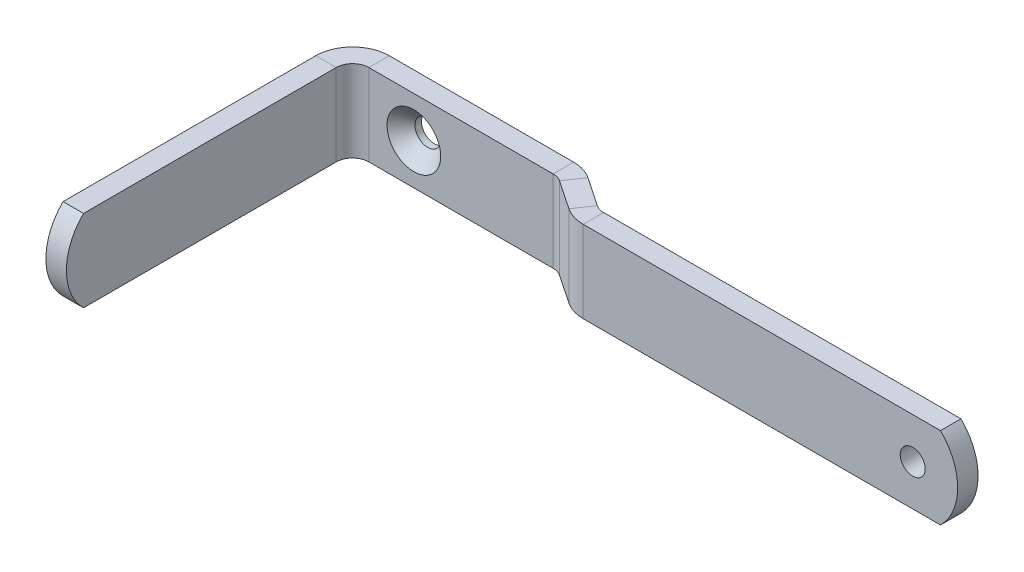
ISO-10303-21;
HEADER;
FILE_DESCRIPTION(('STEP AP214'),'2;1');
FILE_NAME('part.step','',(''),(''),'','','');
FILE_SCHEMA(('AUTOMOTIVE_DESIGN { 1 0 10303 214 1 1 1 1 }'));
ENDSEC;
DATA;
#1=APPLICATION_CONTEXT('core data for automotive mechanical design processes');
#2=APPLICATION_PROTOCOL_DEFINITION('international standard','automotive_design',2000,#1);
#3=PRODUCT_CONTEXT('',#1,'mechanical');
#4=PRODUCT('Part','Part','',(#3));
#5=PRODUCT_RELATED_PRODUCT_CATEGORY('part','',(#4));
#6=PRODUCT_DEFINITION_FORMATION('','',#4);
#7=PRODUCT_DEFINITION_CONTEXT('part definition',#1,'design');
#8=PRODUCT_DEFINITION('design','',#6,#7);
#9=PRODUCT_DEFINITION_SHAPE('','',#8);
#10=(LENGTH_UNIT() NAMED_UNIT(*) SI_UNIT(.MILLI.,.METRE.));
#11=(NAMED_UNIT(*) PLANE_ANGLE_UNIT() SI_UNIT($,.RADIAN.));
#12=(NAMED_UNIT(*) SI_UNIT($,.STERADIAN.) SOLID_ANGLE_UNIT());
#13=UNCERTAINTY_MEASURE_WITH_UNIT(LENGTH_MEASURE(1.E-05),#10,'distance_accuracy_value','');
#14=(GEOMETRIC_REPRESENTATION_CONTEXT(3) GLOBAL_UNCERTAINTY_ASSIGNED_CONTEXT((#13)) GLOBAL_UNIT_ASSIGNED_CONTEXT((#10,
#11,#12)) REPRESENTATION_CONTEXT('',''));
#15=CARTESIAN_POINT('',(0.,0.,0.));
#16=DIRECTION('',(0.,0.,1.));
#17=DIRECTION('',(1.,0.,0.));
#18=AXIS2_PLACEMENT_3D('',#15,#16,#17);
#19=CARTESIAN_POINT('',(0.,0.,0.));
#20=DIRECTION('',(-1.,0.,0.));
#21=DIRECTION('',(0.,0.,1.));
#22=AXIS2_PLACEMENT_3D('',#19,#20,#21);
#23=PLANE('',#22);
#24=CARTESIAN_POINT('',(0.,0.,-14.));
#25=DIRECTION('',(-1.,0.,0.));
#26=DIRECTION('',(0.,0.,1.));
#27=AXIS2_PLACEMENT_3D('',#24,#25,#26);
#28=CIRCLE('',#27,14.);
#29=CARTESIAN_POINT('',(0.,10.,-4.20204102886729));
#30=VERTEX_POINT('',#29);
#31=CARTESIAN_POINT('',(0.,-10.,-4.20204102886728));
#32=VERTEX_POINT('',#31);
#33=EDGE_CURVE('E169',#30,#32,#28,.F.);
#34=ORIENTED_EDGE('',*,*,#33,.T.);
#35=DIRECTION('',(0.,0.,-1.));
#36=VECTOR('',#35,1.);
#37=CARTESIAN_POINT('',(0.,-10.,0.));
#38=LINE('',#37,#36);
#39=CARTESIAN_POINT('',(0.,-9.99999999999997,-66.));
#40=VERTEX_POINT('',#39);
#41=EDGE_CURVE('E173',#32,#40,#38,.T.);
#42=ORIENTED_EDGE('',*,*,#41,.T.);
#43=DIRECTION('',(0.,1.,0.));
#44=VECTOR('',#43,1.);
#45=CARTESIAN_POINT('',(0.,10.,-66.));
#46=LINE('',#45,#44);
#47=CARTESIAN_POINT('',(0.,9.99999999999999,-66.));
#48=VERTEX_POINT('',#47);
#49=EDGE_CURVE('E393',#48,#40,#46,.F.);
#50=ORIENTED_EDGE('',*,*,#49,.F.);
#51=DIRECTION('',(0.,0.,1.));
#52=VECTOR('',#51,1.);
#53=CARTESIAN_POINT('',(0.,10.,0.));
#54=LINE('',#53,#52);
#55=EDGE_CURVE('E176',#48,#30,#54,.T.);
#56=ORIENTED_EDGE('',*,*,#55,.T.);
#57=EDGE_LOOP('',(#34,#42,#50,#56));
#58=FACE_BOUND('',#57,.T.);
#59=ADVANCED_FACE('F57',(#58),#23,.F.);
#60=CARTESIAN_POINT('',(-5.,0.,0.));
#61=DIRECTION('',(-1.,0.,0.));
#62=DIRECTION('',(0.,0.,1.));
#63=AXIS2_PLACEMENT_3D('',#60,#61,#62);
#64=PLANE('',#63);
#65=DIRECTION('',(0.,0.,-1.));
#66=VECTOR('',#65,1.);
#67=CARTESIAN_POINT('',(-5.,-10.,0.));
#68=LINE('',#67,#66);
#69=CARTESIAN_POINT('',(-5.,-10.,-4.20204102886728));
#70=VERTEX_POINT('',#69);
#71=CARTESIAN_POINT('',(-5.,-9.99999999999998,-66.));
#72=VERTEX_POINT('',#71);
#73=EDGE_CURVE('E190',#70,#72,#68,.T.);
#74=ORIENTED_EDGE('',*,*,#73,.F.);
#75=CARTESIAN_POINT('',(-5.,0.,-14.));
#76=DIRECTION('',(-1.,0.,0.));
#77=DIRECTION('',(0.,0.,1.));
#78=AXIS2_PLACEMENT_3D('',#75,#76,#77);
#79=CIRCLE('',#78,14.);
#80=CARTESIAN_POINT('',(-5.,10.,-4.20204102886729));
#81=VERTEX_POINT('',#80);
#82=EDGE_CURVE('E177',#81,#70,#79,.F.);
#83=ORIENTED_EDGE('',*,*,#82,.F.);
#84=DIRECTION('',(0.,0.,1.));
#85=VECTOR('',#84,1.);
#86=CARTESIAN_POINT('',(-5.,10.,0.));
#87=LINE('',#86,#85);
#88=CARTESIAN_POINT('',(-5.00000000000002,9.99999999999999,-66.));
#89=VERTEX_POINT('',#88);
#90=EDGE_CURVE('E194',#89,#81,#87,.T.);
#91=ORIENTED_EDGE('',*,*,#90,.F.);
#92=DIRECTION('',(0.,1.,0.));
#93=VECTOR('',#92,1.);
#94=CARTESIAN_POINT('',(-5.00000000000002,10.,-66.));
#95=LINE('',#94,#93);
#96=EDGE_CURVE('E192',#89,#72,#95,.F.);
#97=ORIENTED_EDGE('',*,*,#96,.T.);
#98=EDGE_LOOP('',(#74,#83,#91,#97));
#99=FACE_BOUND('',#98,.T.);
#100=ADVANCED_FACE('F262',(#99),#64,.T.);
#101=CARTESIAN_POINT('',(-5.,-10.,0.));
#102=DIRECTION('',(0.,-1.,0.));
#103=DIRECTION('',(0.,0.,-1.));
#104=AXIS2_PLACEMENT_3D('',#101,#102,#103);
#105=PLANE('',#104);
#106=ORIENTED_EDGE('',*,*,#41,.F.);
#107=DIRECTION('',(1.,0.,0.));
#108=VECTOR('',#107,1.);
#109=CARTESIAN_POINT('',(0.,-10.,-4.20204102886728));
#110=LINE('',#109,#108);
#111=EDGE_CURVE('E180',#32,#70,#110,.F.);
#112=ORIENTED_EDGE('',*,*,#111,.T.);
#113=ORIENTED_EDGE('',*,*,#73,.T.);
#114=DIRECTION('',(-1.,0.,0.));
#115=VECTOR('',#114,1.);
#116=CARTESIAN_POINT('',(0.,-9.99999999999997,-66.));
#117=LINE('',#116,#115);
#118=EDGE_CURVE('E189',#40,#72,#117,.T.);
#119=ORIENTED_EDGE('',*,*,#118,.F.);
#120=EDGE_LOOP('',(#106,#112,#113,#119));
#121=FACE_BOUND('',#120,.T.);
#122=ADVANCED_FACE('F187',(#121),#105,.T.);
#123=CARTESIAN_POINT('',(-5.,10.,0.));
#124=DIRECTION('',(0.,1.,0.));
#125=DIRECTION('',(0.,0.,1.));
#126=AXIS2_PLACEMENT_3D('',#123,#124,#125);
#127=PLANE('',#126);
#128=ORIENTED_EDGE('',*,*,#90,.T.);
#129=DIRECTION('',(-1.,0.,0.));
#130=VECTOR('',#129,1.);
#131=CARTESIAN_POINT('',(-5.,10.,-4.20204102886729));
#132=LINE('',#131,#130);
#133=EDGE_CURVE('E72',#81,#30,#132,.F.);
#134=ORIENTED_EDGE('',*,*,#133,.T.);
#135=ORIENTED_EDGE('',*,*,#55,.F.);
#136=DIRECTION('',(-1.,0.,0.));
#137=VECTOR('',#136,1.);
#138=CARTESIAN_POINT('',(0.,9.99999999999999,-66.));
#139=LINE('',#138,#137);
#140=EDGE_CURVE('E200',#48,#89,#139,.T.);
#141=ORIENTED_EDGE('',*,*,#140,.T.);
#142=EDGE_LOOP('',(#128,#134,#135,#141));
#143=FACE_BOUND('',#142,.T.);
#144=ADVANCED_FACE('F271',(#143),#127,.T.);
#145=CARTESIAN_POINT('',(-1.90547234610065,0.,-68.));
#146=DIRECTION('',(0.,0.,1.));
#147=DIRECTION('',(1.,0.,0.));
#148=AXIS2_PLACEMENT_3D('',#145,#146,#147);
#149=PLANE('',#148);
#150=CARTESIAN_POINT('',(144.,0.,-68.0000000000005));
#151=DIRECTION('',(0.,0.,1.));
#152=DIRECTION('',(1.,0.,0.));
#153=AXIS2_PLACEMENT_3D('',#150,#151,#152);
#154=CIRCLE('',#153,3.05000000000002);
#155=CARTESIAN_POINT('',(147.05,0.,-68.0000000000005));
#156=VERTEX_POINT('',#155);
#157=EDGE_CURVE('E776',#156,#156,#154,.T.);
#158=ORIENTED_EDGE('',*,*,#157,.T.);
#159=EDGE_LOOP('',(#158));
#160=FACE_BOUND('',#159,.T.);
#161=DIRECTION('',(1.,0.,0.));
#162=VECTOR('',#161,1.);
#163=CARTESIAN_POINT('',(153.0945276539,9.99999999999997,-68.0000000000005));
#164=LINE('',#163,#162);
#165=CARTESIAN_POINT('',(63.423836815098,9.99999999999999,-68.0000000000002));
#166=VERTEX_POINT('',#165);
#167=CARTESIAN_POINT('',(150.797958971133,9.99999999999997,-68.0000000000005));
#168=VERTEX_POINT('',#167);
#169=EDGE_CURVE('E426',#166,#168,#164,.T.);
#170=ORIENTED_EDGE('',*,*,#169,.T.);
#171=CARTESIAN_POINT('',(141.,0.,-68.0000000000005));
#172=DIRECTION('',(0.,0.,1.));
#173=DIRECTION('',(1.,0.,0.));
#174=AXIS2_PLACEMENT_3D('',#171,#172,#173);
#175=CIRCLE('',#174,14.);
#176=CARTESIAN_POINT('',(150.797958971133,-9.99999999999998,-68.0000000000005));
#177=VERTEX_POINT('',#176);
#178=EDGE_CURVE('E410',#177,#168,#175,.T.);
#179=ORIENTED_EDGE('',*,*,#178,.F.);
#180=DIRECTION('',(-1.,0.,0.));
#181=VECTOR('',#180,1.);
#182=CARTESIAN_POINT('',(-1.90547234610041,-9.99999999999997,-68.));
#183=LINE('',#182,#181);
#184=CARTESIAN_POINT('',(63.423836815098,-9.99999999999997,-68.0000000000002));
#185=VERTEX_POINT('',#184);
#186=EDGE_CURVE('E432',#177,#185,#183,.T.);
#187=ORIENTED_EDGE('',*,*,#186,.T.);
#188=DIRECTION('',(0.,1.,0.));
#189=VECTOR('',#188,1.);
#190=CARTESIAN_POINT('',(63.423836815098,0.,-68.0000000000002));
#191=LINE('',#190,#189);
#192=EDGE_CURVE('E429',#185,#166,#191,.T.);
#193=ORIENTED_EDGE('',*,*,#192,.T.);
#194=EDGE_LOOP('',(#170,#179,#187,#193));
#195=FACE_BOUND('',#194,.T.);
#196=ADVANCED_FACE('F448',(#160,#195),#149,.F.);
#197=CARTESIAN_POINT('',(-1.90547234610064,0.,-63.));
#198=DIRECTION('',(0.,0.,1.));
#199=DIRECTION('',(1.,0.,0.));
#200=AXIS2_PLACEMENT_3D('',#197,#198,#199);
#201=PLANE('',#200);
#202=CARTESIAN_POINT('',(144.,0.,-63.));
#203=DIRECTION('',(0.,0.,1.));
#204=DIRECTION('',(1.,0.,0.));
#205=AXIS2_PLACEMENT_3D('',#202,#203,#204);
#206=CIRCLE('',#205,3.05000000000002);
#207=CARTESIAN_POINT('',(147.05,0.,-63.));
#208=VERTEX_POINT('',#207);
#209=EDGE_CURVE('E775',#208,#208,#206,.T.);
#210=ORIENTED_EDGE('',*,*,#209,.F.);
#211=EDGE_LOOP('',(#210));
#212=FACE_BOUND('',#211,.T.);
#213=CARTESIAN_POINT('',(141.,0.,-63.0000000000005));
#214=DIRECTION('',(0.,0.,1.));
#215=DIRECTION('',(1.,0.,0.));
#216=AXIS2_PLACEMENT_3D('',#213,#214,#215);
#217=CIRCLE('',#216,14.);
#218=CARTESIAN_POINT('',(150.797958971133,-9.99999999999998,-63.0000000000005));
#219=VERTEX_POINT('',#218);
#220=CARTESIAN_POINT('',(150.797958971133,9.99999999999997,-63.0000000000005));
#221=VERTEX_POINT('',#220);
#222=EDGE_CURVE('E80',#219,#221,#217,.T.);
#223=ORIENTED_EDGE('',*,*,#222,.T.);
#224=DIRECTION('',(1.,0.,0.));
#225=VECTOR('',#224,1.);
#226=CARTESIAN_POINT('',(153.0945276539,9.99999999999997,-63.0000000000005));
#227=LINE('',#226,#225);
#228=CARTESIAN_POINT('',(63.423836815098,9.99999999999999,-63.0000000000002));
#229=VERTEX_POINT('',#228);
#230=EDGE_CURVE('E420',#229,#221,#227,.T.);
#231=ORIENTED_EDGE('',*,*,#230,.F.);
#232=DIRECTION('',(0.,1.,0.));
#233=VECTOR('',#232,1.);
#234=CARTESIAN_POINT('',(63.423836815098,0.,-63.0000000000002));
#235=LINE('',#234,#233);
#236=CARTESIAN_POINT('',(63.423836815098,-9.99999999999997,-63.0000000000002));
#237=VERTEX_POINT('',#236);
#238=EDGE_CURVE('E417',#237,#229,#235,.T.);
#239=ORIENTED_EDGE('',*,*,#238,.F.);
#240=DIRECTION('',(-1.,0.,0.));
#241=VECTOR('',#240,1.);
#242=CARTESIAN_POINT('',(-1.9054723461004,-9.99999999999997,-63.));
#243=LINE('',#242,#241);
#244=EDGE_CURVE('E349',#219,#237,#243,.T.);
#245=ORIENTED_EDGE('',*,*,#244,.F.);
#246=EDGE_LOOP('',(#223,#231,#239,#245));
#247=FACE_BOUND('',#246,.T.);
#248=ADVANCED_FACE('F454',(#212,#247),#201,.T.);
#249=CARTESIAN_POINT('',(153.0945276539,9.99999999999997,-68.0000000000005));
#250=DIRECTION('',(0.,-1.,0.));
#251=DIRECTION('',(1.,0.,0.));
#252=AXIS2_PLACEMENT_3D('',#249,#250,#251);
#253=PLANE('',#252);
#254=DIRECTION('',(0.,0.,1.));
#255=VECTOR('',#254,1.);
#256=CARTESIAN_POINT('',(150.797958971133,9.99999999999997,-63.0000000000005));
#257=LINE('',#256,#255);
#258=EDGE_CURVE('E407',#221,#168,#257,.F.);
#259=ORIENTED_EDGE('',*,*,#258,.T.);
#260=ORIENTED_EDGE('',*,*,#169,.F.);
#261=DIRECTION('',(0.,0.,1.));
#262=VECTOR('',#261,1.);
#263=CARTESIAN_POINT('',(63.423836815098,9.99999999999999,-68.0000000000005));
#264=LINE('',#263,#262);
#265=EDGE_CURVE('E423',#166,#229,#264,.T.);
#266=ORIENTED_EDGE('',*,*,#265,.T.);
#267=ORIENTED_EDGE('',*,*,#230,.T.);
#268=EDGE_LOOP('',(#259,#260,#266,#267));
#269=FACE_BOUND('',#268,.T.);
#270=ADVANCED_FACE('F445',(#269),#253,.F.);
#271=CARTESIAN_POINT('',(-1.90547234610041,-9.99999999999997,-68.));
#272=DIRECTION('',(0.,1.,0.));
#273=DIRECTION('',(0.,0.,1.));
#274=AXIS2_PLACEMENT_3D('',#271,#272,#273);
#275=PLANE('',#274);
#276=DIRECTION('',(0.,0.,-1.));
#277=VECTOR('',#276,1.);
#278=CARTESIAN_POINT('',(150.797958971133,-9.99999999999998,-68.0000000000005));
#279=LINE('',#278,#277);
#280=EDGE_CURVE('E415',#177,#219,#279,.F.);
#281=ORIENTED_EDGE('',*,*,#280,.T.);
#282=ORIENTED_EDGE('',*,*,#244,.T.);
#283=DIRECTION('',(0.,0.,-1.));
#284=VECTOR('',#283,1.);
#285=CARTESIAN_POINT('',(63.423836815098,-9.99999999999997,-68.));
#286=LINE('',#285,#284);
#287=EDGE_CURVE('E345',#237,#185,#286,.T.);
#288=ORIENTED_EDGE('',*,*,#287,.T.);
#289=ORIENTED_EDGE('',*,*,#186,.F.);
#290=EDGE_LOOP('',(#281,#282,#288,#289));
#291=FACE_BOUND('',#290,.T.);
#292=ADVANCED_FACE('F319',(#291),#275,.F.);
#293=CARTESIAN_POINT('',(7.42839399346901,0.,-98.9134415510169));
#294=DIRECTION('',(-0.559192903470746,0.,0.829037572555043));
#295=DIRECTION('',(0.829037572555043,0.,0.559192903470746));
#296=AXIS2_PLACEMENT_3D('',#293,#294,#295);
#297=PLANE('',#296);
#298=DIRECTION('',(-0.829037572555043,0.,-0.559192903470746));
#299=VECTOR('',#298,1.);
#300=CARTESIAN_POINT('',(7.42839399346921,-9.99999999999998,-98.9134415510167));
#301=LINE('',#300,#299);
#302=CARTESIAN_POINT('',(58.3911006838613,-9.99999999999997,-64.5386618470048));
#303=VERTEX_POINT('',#302);
#304=CARTESIAN_POINT('',(51.3081827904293,-9.99999999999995,-69.3161502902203));
#305=VERTEX_POINT('',#304);
#306=EDGE_CURVE('E237',#303,#305,#301,.T.);
#307=ORIENTED_EDGE('',*,*,#306,.F.);
#308=DIRECTION('',(0.,1.,0.));
#309=VECTOR('',#308,1.);
#310=CARTESIAN_POINT('',(58.3911006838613,0.,-64.5386618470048));
#311=LINE('',#310,#309);
#312=CARTESIAN_POINT('',(58.3911006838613,9.99999999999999,-64.5386618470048));
#313=VERTEX_POINT('',#312);
#314=EDGE_CURVE('E231',#303,#313,#311,.T.);
#315=ORIENTED_EDGE('',*,*,#314,.T.);
#316=DIRECTION('',(0.829037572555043,0.,0.559192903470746));
#317=VECTOR('',#316,1.);
#318=CARTESIAN_POINT('',(135.929217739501,9.99999999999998,-12.2385415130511));
#319=LINE('',#318,#317);
#320=CARTESIAN_POINT('',(51.3081827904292,9.99999999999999,-69.3161502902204));
#321=VERTEX_POINT('',#320);
#322=EDGE_CURVE('E240',#321,#313,#319,.T.);
#323=ORIENTED_EDGE('',*,*,#322,.F.);
#324=DIRECTION('',(0.,1.,0.));
#325=VECTOR('',#324,1.);
#326=CARTESIAN_POINT('',(51.3081827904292,0.,-69.3161502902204));
#327=LINE('',#326,#325);
#328=EDGE_CURVE('E220',#305,#321,#327,.T.);
#329=ORIENTED_EDGE('',*,*,#328,.F.);
#330=EDGE_LOOP('',(#307,#315,#323,#329));
#331=FACE_BOUND('',#330,.T.);
#332=ADVANCED_FACE('F313',(#331),#297,.T.);
#333=CARTESIAN_POINT('',(10.2243585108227,0.,-103.058629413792));
#334=DIRECTION('',(-0.559192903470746,0.,0.829037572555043));
#335=DIRECTION('',(0.829037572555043,0.,0.559192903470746));
#336=AXIS2_PLACEMENT_3D('',#333,#334,#335);
#337=PLANE('',#336);
#338=DIRECTION('',(0.,1.,0.));
#339=VECTOR('',#338,1.);
#340=CARTESIAN_POINT('',(61.187065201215,0.,-68.68384970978));
#341=LINE('',#340,#339);
#342=CARTESIAN_POINT('',(61.187065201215,-9.99999999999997,-68.68384970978));
#343=VERTEX_POINT('',#342);
#344=CARTESIAN_POINT('',(61.187065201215,9.99999999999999,-68.68384970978));
#345=VERTEX_POINT('',#344);
#346=EDGE_CURVE('E225',#343,#345,#341,.T.);
#347=ORIENTED_EDGE('',*,*,#346,.F.);
#348=DIRECTION('',(-0.829037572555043,0.,-0.559192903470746));
#349=VECTOR('',#348,1.);
#350=CARTESIAN_POINT('',(10.2243585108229,-9.99999999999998,-103.058629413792));
#351=LINE('',#350,#349);
#352=CARTESIAN_POINT('',(54.104147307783,-9.99999999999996,-73.4613381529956));
#353=VERTEX_POINT('',#352);
#354=EDGE_CURVE('E243',#343,#353,#351,.T.);
#355=ORIENTED_EDGE('',*,*,#354,.T.);
#356=DIRECTION('',(0.,1.,0.));
#357=VECTOR('',#356,1.);
#358=CARTESIAN_POINT('',(54.104147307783,0.,-73.4613381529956));
#359=LINE('',#358,#357);
#360=CARTESIAN_POINT('',(54.104147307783,9.99999999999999,-73.4613381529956));
#361=VERTEX_POINT('',#360);
#362=EDGE_CURVE('E213',#353,#361,#359,.T.);
#363=ORIENTED_EDGE('',*,*,#362,.T.);
#364=DIRECTION('',(0.829037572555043,0.,0.559192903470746));
#365=VECTOR('',#364,1.);
#366=CARTESIAN_POINT('',(138.725182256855,9.99999999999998,-16.3837293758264));
#367=LINE('',#366,#365);
#368=EDGE_CURVE('E217',#361,#345,#367,.T.);
#369=ORIENTED_EDGE('',*,*,#368,.T.);
#370=EDGE_LOOP('',(#347,#355,#363,#369));
#371=FACE_BOUND('',#370,.T.);
#372=ADVANCED_FACE('F309',(#371),#337,.F.);
#373=CARTESIAN_POINT('',(138.725182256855,9.99999999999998,-16.3837293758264));
#374=DIRECTION('',(0.,-1.,0.));
#375=DIRECTION('',(0.829037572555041,0.,0.559192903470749));
#376=AXIS2_PLACEMENT_3D('',#373,#374,#375);
#377=PLANE('',#376);
#378=DIRECTION('',(-0.559192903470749,0.,0.829037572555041));
#379=VECTOR('',#378,1.);
#380=CARTESIAN_POINT('',(61.1870652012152,9.99999999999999,-68.6838497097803));
#381=LINE('',#380,#379);
#382=EDGE_CURVE('E228',#345,#313,#381,.T.);
#383=ORIENTED_EDGE('',*,*,#382,.F.);
#384=ORIENTED_EDGE('',*,*,#368,.F.);
#385=DIRECTION('',(-0.559192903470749,0.,0.829037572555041));
#386=VECTOR('',#385,1.);
#387=CARTESIAN_POINT('',(54.1041473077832,9.99999999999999,-73.4613381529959));
#388=LINE('',#387,#386);
#389=EDGE_CURVE('E222',#361,#321,#388,.T.);
#390=ORIENTED_EDGE('',*,*,#389,.T.);
#391=ORIENTED_EDGE('',*,*,#322,.T.);
#392=EDGE_LOOP('',(#383,#384,#390,#391));
#393=FACE_BOUND('',#392,.T.);
#394=ADVANCED_FACE('F312',(#393),#377,.F.);
#395=CARTESIAN_POINT('',(10.2243585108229,-9.99999999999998,-103.058629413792));
#396=DIRECTION('',(0.,1.,0.));
#397=DIRECTION('',(-0.559192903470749,0.,0.829037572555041));
#398=AXIS2_PLACEMENT_3D('',#395,#396,#397);
#399=PLANE('',#398);
#400=DIRECTION('',(0.559192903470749,0.,-0.829037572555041));
#401=VECTOR('',#400,1.);
#402=CARTESIAN_POINT('',(61.1870652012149,-9.99999999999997,-68.6838497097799));
#403=LINE('',#402,#401);
#404=EDGE_CURVE('E234',#303,#343,#403,.T.);
#405=ORIENTED_EDGE('',*,*,#404,.F.);
#406=ORIENTED_EDGE('',*,*,#306,.T.);
#407=DIRECTION('',(0.559192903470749,0.,-0.829037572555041));
#408=VECTOR('',#407,1.);
#409=CARTESIAN_POINT('',(54.1041473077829,-9.99999999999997,-73.4613381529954));
#410=LINE('',#409,#408);
#411=EDGE_CURVE('E216',#305,#353,#410,.T.);
#412=ORIENTED_EDGE('',*,*,#411,.T.);
#413=ORIENTED_EDGE('',*,*,#354,.F.);
#414=EDGE_LOOP('',(#405,#406,#412,#413));
#415=FACE_BOUND('',#414,.T.);
#416=ADVANCED_FACE('F279',(#415),#399,.F.);
#417=CARTESIAN_POINT('',(3.99999999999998,9.99999999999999,-66.));
#418=DIRECTION('',(0.,-1.,0.));
#419=DIRECTION('',(0.,0.,-1.));
#420=AXIS2_PLACEMENT_3D('',#417,#418,#419);
#421=PLANE('',#420);
#422=CARTESIAN_POINT('',(3.99999999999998,9.99999999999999,-66.));
#423=DIRECTION('',(0.,1.,0.));
#424=DIRECTION('',(0.,0.,1.));
#425=AXIS2_PLACEMENT_3D('',#422,#423,#424);
#426=CIRCLE('',#425,3.99999999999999);
#427=CARTESIAN_POINT('',(3.99999999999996,9.99999999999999,-70.));
#428=VERTEX_POINT('',#427);
#429=EDGE_CURVE('E385',#428,#48,#426,.T.);
#430=ORIENTED_EDGE('',*,*,#429,.F.);
#431=DIRECTION('',(0.,0.,-1.));
#432=VECTOR('',#431,1.);
#433=CARTESIAN_POINT('',(3.99999999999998,9.99999999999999,-70.));
#434=LINE('',#433,#432);
#435=CARTESIAN_POINT('',(3.99999999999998,10.,-75.));
#436=VERTEX_POINT('',#435);
#437=EDGE_CURVE('E398',#428,#436,#434,.T.);
#438=ORIENTED_EDGE('',*,*,#437,.T.);
#439=CARTESIAN_POINT('',(3.99999999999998,9.99999999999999,-66.));
#440=DIRECTION('',(0.,1.,0.));
#441=DIRECTION('',(0.,0.,1.));
#442=AXIS2_PLACEMENT_3D('',#439,#440,#441);
#443=CIRCLE('',#442,8.99999999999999);
#444=EDGE_CURVE('E395',#436,#89,#443,.T.);
#445=ORIENTED_EDGE('',*,*,#444,.T.);
#446=ORIENTED_EDGE('',*,*,#140,.F.);
#447=EDGE_LOOP('',(#430,#438,#445,#446));
#448=FACE_BOUND('',#447,.T.);
#449=ADVANCED_FACE('F275',(#448),#421,.F.);
#450=CARTESIAN_POINT('',(3.99999999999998,10.,-66.));
#451=DIRECTION('',(0.,1.,0.));
#452=DIRECTION('',(0.,0.,-1.));
#453=AXIS2_PLACEMENT_3D('',#450,#451,#452);
#454=CYLINDRICAL_SURFACE('',#453,3.99999999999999);
#455=ORIENTED_EDGE('',*,*,#49,.T.);
#456=CARTESIAN_POINT('',(3.99999999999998,-9.99999999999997,-66.));
#457=DIRECTION('',(0.,1.,0.));
#458=DIRECTION('',(0.,0.,1.));
#459=AXIS2_PLACEMENT_3D('',#456,#457,#458);
#460=CIRCLE('',#459,3.99999999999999);
#461=CARTESIAN_POINT('',(3.99999999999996,-9.99999999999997,-70.));
#462=VERTEX_POINT('',#461);
#463=EDGE_CURVE('E390',#40,#462,#460,.F.);
#464=ORIENTED_EDGE('',*,*,#463,.T.);
#465=DIRECTION('',(0.,1.,0.));
#466=VECTOR('',#465,1.);
#467=CARTESIAN_POINT('',(3.99999999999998,-9.99999999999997,-70.));
#468=LINE('',#467,#466);
#469=EDGE_CURVE('E388',#462,#428,#468,.T.);
#470=ORIENTED_EDGE('',*,*,#469,.T.);
#471=ORIENTED_EDGE('',*,*,#429,.T.);
#472=EDGE_LOOP('',(#455,#464,#470,#471));
#473=FACE_BOUND('',#472,.T.);
#474=ADVANCED_FACE('F278',(#473),#454,.F.);
#475=CARTESIAN_POINT('',(3.99999999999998,-9.99999999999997,-66.));
#476=DIRECTION('',(0.,-1.,0.));
#477=DIRECTION('',(0.,0.,-1.));
#478=AXIS2_PLACEMENT_3D('',#475,#476,#477);
#479=PLANE('',#478);
#480=DIRECTION('',(0.,0.,-1.));
#481=VECTOR('',#480,1.);
#482=CARTESIAN_POINT('',(3.99999999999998,-9.99999999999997,-70.));
#483=LINE('',#482,#481);
#484=CARTESIAN_POINT('',(3.99999999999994,-9.99999999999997,-75.));
#485=VERTEX_POINT('',#484);
#486=EDGE_CURVE('E369',#462,#485,#483,.T.);
#487=ORIENTED_EDGE('',*,*,#486,.F.);
#488=ORIENTED_EDGE('',*,*,#463,.F.);
#489=ORIENTED_EDGE('',*,*,#118,.T.);
#490=CARTESIAN_POINT('',(3.99999999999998,-9.99999999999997,-66.));
#491=DIRECTION('',(0.,1.,0.));
#492=DIRECTION('',(0.,0.,1.));
#493=AXIS2_PLACEMENT_3D('',#490,#491,#492);
#494=CIRCLE('',#493,8.99999999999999);
#495=EDGE_CURVE('E381',#72,#485,#494,.F.);
#496=ORIENTED_EDGE('',*,*,#495,.T.);
#497=EDGE_LOOP('',(#487,#488,#489,#496));
#498=FACE_BOUND('',#497,.T.);
#499=ADVANCED_FACE('F283',(#498),#479,.T.);
#500=CARTESIAN_POINT('',(3.99999999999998,10.,-66.));
#501=DIRECTION('',(0.,1.,0.));
#502=DIRECTION('',(0.,0.,-1.));
#503=AXIS2_PLACEMENT_3D('',#500,#501,#502);
#504=CYLINDRICAL_SURFACE('',#503,8.99999999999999);
#505=ORIENTED_EDGE('',*,*,#96,.F.);
#506=ORIENTED_EDGE('',*,*,#444,.F.);
#507=DIRECTION('',(0.,-1.,0.));
#508=VECTOR('',#507,1.);
#509=CARTESIAN_POINT('',(3.99999999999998,0.,-75.));
#510=LINE('',#509,#508);
#511=EDGE_CURVE('E378',#436,#485,#510,.T.);
#512=ORIENTED_EDGE('',*,*,#511,.T.);
#513=ORIENTED_EDGE('',*,*,#495,.F.);
#514=EDGE_LOOP('',(#505,#506,#512,#513));
#515=FACE_BOUND('',#514,.T.);
#516=ADVANCED_FACE('F287',(#515),#504,.T.);
#517=CARTESIAN_POINT('',(-2.61885540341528E-13,0.,-75.));
#518=DIRECTION('',(0.,0.,1.));
#519=DIRECTION('',(1.,0.,0.));
#520=AXIS2_PLACEMENT_3D('',#517,#518,#519);
#521=PLANE('',#520);
#522=CARTESIAN_POINT('',(15.,0.,-75.0000000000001));
#523=DIRECTION('',(0.,0.,-1.));
#524=DIRECTION('',(-1.,0.,0.));
#525=AXIS2_PLACEMENT_3D('',#522,#523,#524);
#526=CIRCLE('',#525,3.15);
#527=CARTESIAN_POINT('',(11.85,0.,-75.0000000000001));
#528=VERTEX_POINT('',#527);
#529=EDGE_CURVE('E184',#528,#528,#526,.T.);
#530=ORIENTED_EDGE('',*,*,#529,.F.);
#531=EDGE_LOOP('',(#530));
#532=FACE_BOUND('',#531,.T.);
#533=DIRECTION('',(0.,1.,0.));
#534=VECTOR('',#533,1.);
#535=CARTESIAN_POINT('',(49.0714111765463,0.,-75.0000000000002));
#536=LINE('',#535,#534);
#537=CARTESIAN_POINT('',(49.0714111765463,-9.99999999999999,-75.0000000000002));
#538=VERTEX_POINT('',#537);
#539=CARTESIAN_POINT('',(49.0714111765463,9.99999999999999,-75.0000000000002));
#540=VERTEX_POINT('',#539);
#541=EDGE_CURVE('E209',#538,#540,#536,.T.);
#542=ORIENTED_EDGE('',*,*,#541,.F.);
#543=DIRECTION('',(-1.,0.,0.));
#544=VECTOR('',#543,1.);
#545=CARTESIAN_POINT('',(0.,-9.99999999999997,-75.));
#546=LINE('',#545,#544);
#547=EDGE_CURVE('E376',#538,#485,#546,.T.);
#548=ORIENTED_EDGE('',*,*,#547,.T.);
#549=ORIENTED_EDGE('',*,*,#511,.F.);
#550=DIRECTION('',(1.,0.,0.));
#551=VECTOR('',#550,1.);
#552=CARTESIAN_POINT('',(155.,9.99999999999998,-75.0000000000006));
#553=LINE('',#552,#551);
#554=EDGE_CURVE('E374',#436,#540,#553,.T.);
#555=ORIENTED_EDGE('',*,*,#554,.T.);
#556=EDGE_LOOP('',(#542,#548,#549,#555));
#557=FACE_BOUND('',#556,.T.);
#558=ADVANCED_FACE('F291',(#532,#557),#521,.F.);
#559=CARTESIAN_POINT('',(0.,-9.99999999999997,-75.));
#560=DIRECTION('',(0.,1.,0.));
#561=DIRECTION('',(0.,0.,1.));
#562=AXIS2_PLACEMENT_3D('',#559,#560,#561);
#563=PLANE('',#562);
#564=DIRECTION('',(0.,0.,-1.));
#565=VECTOR('',#564,1.);
#566=CARTESIAN_POINT('',(49.0714111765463,-9.99999999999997,-75.));
#567=LINE('',#566,#565);
#568=CARTESIAN_POINT('',(49.0714111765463,-9.99999999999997,-70.0000000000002));
#569=VERTEX_POINT('',#568);
#570=EDGE_CURVE('E203',#569,#538,#567,.T.);
#571=ORIENTED_EDGE('',*,*,#570,.F.);
#572=DIRECTION('',(-1.,0.,0.));
#573=VECTOR('',#572,1.);
#574=CARTESIAN_POINT('',(0.,-9.99999999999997,-70.));
#575=LINE('',#574,#573);
#576=EDGE_CURVE('E372',#569,#462,#575,.T.);
#577=ORIENTED_EDGE('',*,*,#576,.T.);
#578=ORIENTED_EDGE('',*,*,#486,.T.);
#579=ORIENTED_EDGE('',*,*,#547,.F.);
#580=EDGE_LOOP('',(#571,#577,#578,#579));
#581=FACE_BOUND('',#580,.T.);
#582=ADVANCED_FACE('F295',(#581),#563,.F.);
#583=CARTESIAN_POINT('',(-2.44428133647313E-13,0.,-70.));
#584=DIRECTION('',(0.,0.,1.));
#585=DIRECTION('',(1.,0.,0.));
#586=AXIS2_PLACEMENT_3D('',#583,#584,#585);
#587=PLANE('',#586);
#588=CARTESIAN_POINT('',(15.,0.,-70.0000000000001));
#589=DIRECTION('',(0.,0.,1.));
#590=DIRECTION('',(1.,0.,0.));
#591=AXIS2_PLACEMENT_3D('',#588,#589,#590);
#592=CIRCLE('',#591,6.56999999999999);
#593=CARTESIAN_POINT('',(21.57,0.,-70.0000000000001));
#594=VERTEX_POINT('',#593);
#595=EDGE_CURVE('E14',#594,#594,#592,.F.);
#596=ORIENTED_EDGE('',*,*,#595,.T.);
#597=EDGE_LOOP('',(#596));
#598=FACE_BOUND('',#597,.T.);
#599=ORIENTED_EDGE('',*,*,#576,.F.);
#600=DIRECTION('',(0.,1.,0.));
#601=VECTOR('',#600,1.);
#602=CARTESIAN_POINT('',(49.0714111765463,0.,-70.0000000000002));
#603=LINE('',#602,#601);
#604=CARTESIAN_POINT('',(49.0714111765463,9.99999999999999,-70.0000000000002));
#605=VERTEX_POINT('',#604);
#606=EDGE_CURVE('E366',#569,#605,#603,.T.);
#607=ORIENTED_EDGE('',*,*,#606,.T.);
#608=DIRECTION('',(1.,0.,0.));
#609=VECTOR('',#608,1.);
#610=CARTESIAN_POINT('',(155.,9.99999999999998,-70.0000000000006));
#611=LINE('',#610,#609);
#612=EDGE_CURVE('E241',#428,#605,#611,.T.);
#613=ORIENTED_EDGE('',*,*,#612,.F.);
#614=ORIENTED_EDGE('',*,*,#469,.F.);
#615=EDGE_LOOP('',(#599,#607,#613,#614));
#616=FACE_BOUND('',#615,.T.);
#617=ADVANCED_FACE('F299',(#598,#616),#587,.T.);
#618=CARTESIAN_POINT('',(155.,9.99999999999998,-75.0000000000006));
#619=DIRECTION('',(0.,-1.,0.));
#620=DIRECTION('',(1.,0.,0.));
#621=AXIS2_PLACEMENT_3D('',#618,#619,#620);
#622=PLANE('',#621);
#623=DIRECTION('',(0.,0.,1.));
#624=VECTOR('',#623,1.);
#625=CARTESIAN_POINT('',(49.0714111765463,9.99999999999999,-75.0000000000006));
#626=LINE('',#625,#624);
#627=EDGE_CURVE('E206',#540,#605,#626,.T.);
#628=ORIENTED_EDGE('',*,*,#627,.F.);
#629=ORIENTED_EDGE('',*,*,#554,.F.);
#630=ORIENTED_EDGE('',*,*,#437,.F.);
#631=ORIENTED_EDGE('',*,*,#612,.T.);
#632=EDGE_LOOP('',(#628,#629,#630,#631));
#633=FACE_BOUND('',#632,.T.);
#634=ADVANCED_FACE('F303',(#633),#622,.F.);
#635=CARTESIAN_POINT('',(49.0714111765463,-9.99999999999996,-66.0000000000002));
#636=DIRECTION('',(0.,-1.,0.));
#637=DIRECTION('',(1.,0.,0.));
#638=AXIS2_PLACEMENT_3D('',#635,#636,#637);
#639=PLANE('',#638);
#640=ORIENTED_EDGE('',*,*,#411,.F.);
#641=CARTESIAN_POINT('',(49.0714111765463,-9.99999999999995,-66.0000000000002));
#642=DIRECTION('',(0.,-1.,0.));
#643=DIRECTION('',(1.,0.,0.));
#644=AXIS2_PLACEMENT_3D('',#641,#642,#643);
#645=CIRCLE('',#644,3.99999999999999);
#646=EDGE_CURVE('E361',#305,#569,#645,.F.);
#647=ORIENTED_EDGE('',*,*,#646,.T.);
#648=ORIENTED_EDGE('',*,*,#570,.T.);
#649=CARTESIAN_POINT('',(49.0714111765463,-9.99999999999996,-66.0000000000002));
#650=DIRECTION('',(0.,1.,0.));
#651=DIRECTION('',(-1.,0.,0.));
#652=AXIS2_PLACEMENT_3D('',#649,#650,#651);
#653=CIRCLE('',#652,8.99999999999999);
#654=EDGE_CURVE('E353',#353,#538,#653,.T.);
#655=ORIENTED_EDGE('',*,*,#654,.F.);
#656=EDGE_LOOP('',(#640,#647,#648,#655));
#657=FACE_BOUND('',#656,.T.);
#658=ADVANCED_FACE('F307',(#657),#639,.T.);
#659=CARTESIAN_POINT('',(49.0714111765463,9.99999999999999,-66.0000000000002));
#660=DIRECTION('',(0.,1.,0.));
#661=DIRECTION('',(0.,0.,1.));
#662=AXIS2_PLACEMENT_3D('',#659,#660,#661);
#663=PLANE('',#662);
#664=ORIENTED_EDGE('',*,*,#627,.T.);
#665=CARTESIAN_POINT('',(49.0714111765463,9.99999999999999,-66.0000000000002));
#666=DIRECTION('',(0.,-1.,0.));
#667=DIRECTION('',(1.,0.,0.));
#668=AXIS2_PLACEMENT_3D('',#665,#666,#667);
#669=CIRCLE('',#668,3.99999999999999);
#670=EDGE_CURVE('E356',#605,#321,#669,.T.);
#671=ORIENTED_EDGE('',*,*,#670,.T.);
#672=ORIENTED_EDGE('',*,*,#389,.F.);
#673=CARTESIAN_POINT('',(49.0714111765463,9.99999999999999,-66.0000000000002));
#674=DIRECTION('',(0.,-1.,0.));
#675=DIRECTION('',(0.,0.,-1.));
#676=AXIS2_PLACEMENT_3D('',#673,#674,#675);
#677=CIRCLE('',#676,8.99999999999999);
#678=EDGE_CURVE('E212',#540,#361,#677,.T.);
#679=ORIENTED_EDGE('',*,*,#678,.F.);
#680=EDGE_LOOP('',(#664,#671,#672,#679));
#681=FACE_BOUND('',#680,.T.);
#682=ADVANCED_FACE('F486',(#681),#663,.T.);
#683=CARTESIAN_POINT('',(49.0714111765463,20.9732643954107,-66.0000000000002));
#684=DIRECTION('',(0.,-1.,0.));
#685=DIRECTION('',(1.,0.,0.));
#686=AXIS2_PLACEMENT_3D('',#683,#684,#685);
#687=CYLINDRICAL_SURFACE('',#686,8.99999999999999);
#688=ORIENTED_EDGE('',*,*,#678,.T.);
#689=ORIENTED_EDGE('',*,*,#362,.F.);
#690=ORIENTED_EDGE('',*,*,#654,.T.);
#691=ORIENTED_EDGE('',*,*,#541,.T.);
#692=EDGE_LOOP('',(#688,#689,#690,#691));
#693=FACE_BOUND('',#692,.T.);
#694=ADVANCED_FACE('F483',(#693),#687,.T.);
#695=CARTESIAN_POINT('',(49.0714111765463,20.9732643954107,-66.0000000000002));
#696=DIRECTION('',(0.,-1.,0.));
#697=DIRECTION('',(1.,0.,0.));
#698=AXIS2_PLACEMENT_3D('',#695,#696,#697);
#699=CYLINDRICAL_SURFACE('',#698,3.99999999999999);
#700=ORIENTED_EDGE('',*,*,#670,.F.);
#701=ORIENTED_EDGE('',*,*,#606,.F.);
#702=ORIENTED_EDGE('',*,*,#646,.F.);
#703=ORIENTED_EDGE('',*,*,#328,.T.);
#704=EDGE_LOOP('',(#700,#701,#702,#703));
#705=FACE_BOUND('',#704,.T.);
#706=ADVANCED_FACE('F482',(#705),#699,.F.);
#707=CARTESIAN_POINT('',(63.423836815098,-9.99999999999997,-72.0000000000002));
#708=DIRECTION('',(0.,1.,0.));
#709=DIRECTION('',(0.,0.,1.));
#710=AXIS2_PLACEMENT_3D('',#707,#708,#709);
#711=PLANE('',#710);
#712=ORIENTED_EDGE('',*,*,#287,.F.);
#713=CARTESIAN_POINT('',(63.423836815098,-9.99999999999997,-72.0000000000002));
#714=DIRECTION('',(0.,-1.,0.));
#715=DIRECTION('',(0.,0.,-1.));
#716=AXIS2_PLACEMENT_3D('',#713,#714,#715);
#717=CIRCLE('',#716,8.99999999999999);
#718=EDGE_CURVE('E338',#237,#303,#717,.T.);
#719=ORIENTED_EDGE('',*,*,#718,.T.);
#720=ORIENTED_EDGE('',*,*,#404,.T.);
#721=CARTESIAN_POINT('',(63.423836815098,-9.99999999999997,-72.0000000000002));
#722=DIRECTION('',(0.,-1.,0.));
#723=DIRECTION('',(0.,0.,-1.));
#724=AXIS2_PLACEMENT_3D('',#721,#722,#723);
#725=CIRCLE('',#724,3.99999999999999);
#726=EDGE_CURVE('E347',#185,#343,#725,.T.);
#727=ORIENTED_EDGE('',*,*,#726,.F.);
#728=EDGE_LOOP('',(#712,#719,#720,#727));
#729=FACE_BOUND('',#728,.T.);
#730=ADVANCED_FACE('F343',(#729),#711,.F.);
#731=CARTESIAN_POINT('',(63.423836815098,9.99999999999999,-72.0000000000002));
#732=DIRECTION('',(0.,-1.,0.));
#733=DIRECTION('',(0.,0.,-1.));
#734=AXIS2_PLACEMENT_3D('',#731,#732,#733);
#735=PLANE('',#734);
#736=ORIENTED_EDGE('',*,*,#382,.T.);
#737=CARTESIAN_POINT('',(63.423836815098,9.99999999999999,-72.0000000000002));
#738=DIRECTION('',(0.,-1.,0.));
#739=DIRECTION('',(0.,0.,-1.));
#740=AXIS2_PLACEMENT_3D('',#737,#738,#739);
#741=CIRCLE('',#740,8.99999999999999);
#742=EDGE_CURVE('E340',#313,#229,#741,.F.);
#743=ORIENTED_EDGE('',*,*,#742,.T.);
#744=ORIENTED_EDGE('',*,*,#265,.F.);
#745=CARTESIAN_POINT('',(63.423836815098,9.99999999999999,-72.0000000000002));
#746=DIRECTION('',(0.,1.,0.));
#747=DIRECTION('',(0.,0.,1.));
#748=AXIS2_PLACEMENT_3D('',#745,#746,#747);
#749=CIRCLE('',#748,3.99999999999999);
#750=EDGE_CURVE('E364',#345,#166,#749,.T.);
#751=ORIENTED_EDGE('',*,*,#750,.F.);
#752=EDGE_LOOP('',(#736,#743,#744,#751));
#753=FACE_BOUND('',#752,.T.);
#754=ADVANCED_FACE('F442',(#753),#735,.F.);
#755=CARTESIAN_POINT('',(63.423836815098,21.8091941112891,-72.0000000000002));
#756=DIRECTION('',(0.,-1.,0.));
#757=DIRECTION('',(0.,0.,-1.));
#758=AXIS2_PLACEMENT_3D('',#755,#756,#757);
#759=CYLINDRICAL_SURFACE('',#758,3.99999999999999);
#760=ORIENTED_EDGE('',*,*,#750,.T.);
#761=ORIENTED_EDGE('',*,*,#192,.F.);
#762=ORIENTED_EDGE('',*,*,#726,.T.);
#763=ORIENTED_EDGE('',*,*,#346,.T.);
#764=EDGE_LOOP('',(#760,#761,#762,#763));
#765=FACE_BOUND('',#764,.T.);
#766=ADVANCED_FACE('F439',(#765),#759,.F.);
#767=CARTESIAN_POINT('',(63.423836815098,21.8091941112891,-72.0000000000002));
#768=DIRECTION('',(0.,-1.,0.));
#769=DIRECTION('',(0.,0.,-1.));
#770=AXIS2_PLACEMENT_3D('',#767,#768,#769);
#771=CYLINDRICAL_SURFACE('',#770,8.99999999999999);
#772=ORIENTED_EDGE('',*,*,#742,.F.);
#773=ORIENTED_EDGE('',*,*,#314,.F.);
#774=ORIENTED_EDGE('',*,*,#718,.F.);
#775=ORIENTED_EDGE('',*,*,#238,.T.);
#776=EDGE_LOOP('',(#772,#773,#774,#775));
#777=FACE_BOUND('',#776,.T.);
#778=ADVANCED_FACE('F336',(#777),#771,.T.);
#779=CARTESIAN_POINT('',(141.,0.,-68.0000000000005));
#780=DIRECTION('',(0.,0.,1.));
#781=DIRECTION('',(1.,0.,0.));
#782=AXIS2_PLACEMENT_3D('',#779,#780,#781);
#783=CYLINDRICAL_SURFACE('',#782,14.);
#784=ORIENTED_EDGE('',*,*,#178,.T.);
#785=ORIENTED_EDGE('',*,*,#258,.F.);
#786=ORIENTED_EDGE('',*,*,#222,.F.);
#787=ORIENTED_EDGE('',*,*,#280,.F.);
#788=EDGE_LOOP('',(#784,#785,#786,#787));
#789=FACE_BOUND('',#788,.T.);
#790=ADVANCED_FACE('F455',(#789),#783,.T.);
#791=CARTESIAN_POINT('',(-5.,0.,-14.));
#792=DIRECTION('',(-1.,0.,0.));
#793=DIRECTION('',(0.,0.,1.));
#794=AXIS2_PLACEMENT_3D('',#791,#792,#793);
#795=CYLINDRICAL_SURFACE('',#794,14.);
#796=ORIENTED_EDGE('',*,*,#82,.T.);
#797=ORIENTED_EDGE('',*,*,#111,.F.);
#798=ORIENTED_EDGE('',*,*,#33,.F.);
#799=ORIENTED_EDGE('',*,*,#133,.F.);
#800=EDGE_LOOP('',(#796,#797,#798,#799));
#801=FACE_BOUND('',#800,.T.);
#802=ADVANCED_FACE('F181',(#801),#795,.T.);
#803=CARTESIAN_POINT('',(15.0000000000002,0.,4.85722573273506E-13));
#804=DIRECTION('',(0.,0.,-1.));
#805=DIRECTION('',(-1.,0.,0.));
#806=AXIS2_PLACEMENT_3D('',#803,#804,#805);
#807=CYLINDRICAL_SURFACE('',#806,3.15);
#808=CARTESIAN_POINT('',(15.,0.,-73.42));
#809=DIRECTION('',(0.,0.,1.));
#810=DIRECTION('',(1.,0.,0.));
#811=AXIS2_PLACEMENT_3D('',#808,#809,#810);
#812=CIRCLE('',#811,3.15);
#813=CARTESIAN_POINT('',(18.15,0.,-73.4200000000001));
#814=VERTEX_POINT('',#813);
#815=EDGE_CURVE('E65',#814,#814,#812,.T.);
#816=ORIENTED_EDGE('',*,*,#815,.T.);
#817=EDGE_LOOP('',(#816));
#818=FACE_BOUND('',#817,.T.);
#819=ORIENTED_EDGE('',*,*,#529,.T.);
#820=EDGE_LOOP('',(#819));
#821=FACE_BOUND('',#820,.T.);
#822=ADVANCED_FACE('F249',(#818,#821),#807,.F.);
#823=CARTESIAN_POINT('',(144.,0.,-75.0000000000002));
#824=DIRECTION('',(0.,0.,1.));
#825=DIRECTION('',(1.,0.,0.));
#826=AXIS2_PLACEMENT_3D('',#823,#824,#825);
#827=CYLINDRICAL_SURFACE('',#826,3.05000000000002);
#828=ORIENTED_EDGE('',*,*,#209,.T.);
#829=EDGE_LOOP('',(#828));
#830=FACE_BOUND('',#829,.T.);
#831=ORIENTED_EDGE('',*,*,#157,.F.);
#832=EDGE_LOOP('',(#831));
#833=FACE_BOUND('',#832,.T.);
#834=ADVANCED_FACE('F253',(#830,#833),#827,.F.);
#835=CARTESIAN_POINT('',(15.,0.,-73.42));
#836=DIRECTION('',(0.,0.,1.));
#837=DIRECTION('',(1.,0.,0.));
#838=AXIS2_PLACEMENT_3D('',#835,#836,#837);
#839=CONICAL_SURFACE('',#838,3.15,0.785398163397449);
#840=ORIENTED_EDGE('',*,*,#595,.F.);
#841=EDGE_LOOP('',(#840));
#842=FACE_BOUND('',#841,.T.);
#843=ORIENTED_EDGE('',*,*,#815,.F.);
#844=EDGE_LOOP('',(#843));
#845=FACE_BOUND('',#844,.T.);
#846=ADVANCED_FACE('F59',(#842,#845),#839,.F.);
#847=CLOSED_SHELL('',(#59,#100,#122,#144,#196,#248,#270,#292,#332,#372,#394,#416,#449,#474,#499,
#516,#558,#582,#617,#634,#658,#682,#694,#706,#730,#754,#766,#778,#790,#802,#822,#834,#846));
#848=MANIFOLD_SOLID_BREP('B2',#847);
#849=ADVANCED_BREP_SHAPE_REPRESENTATION('',(#18,#848),#14);
#850=SHAPE_DEFINITION_REPRESENTATION(#9,#849);
ENDSEC;
END-ISO-10303-21;
